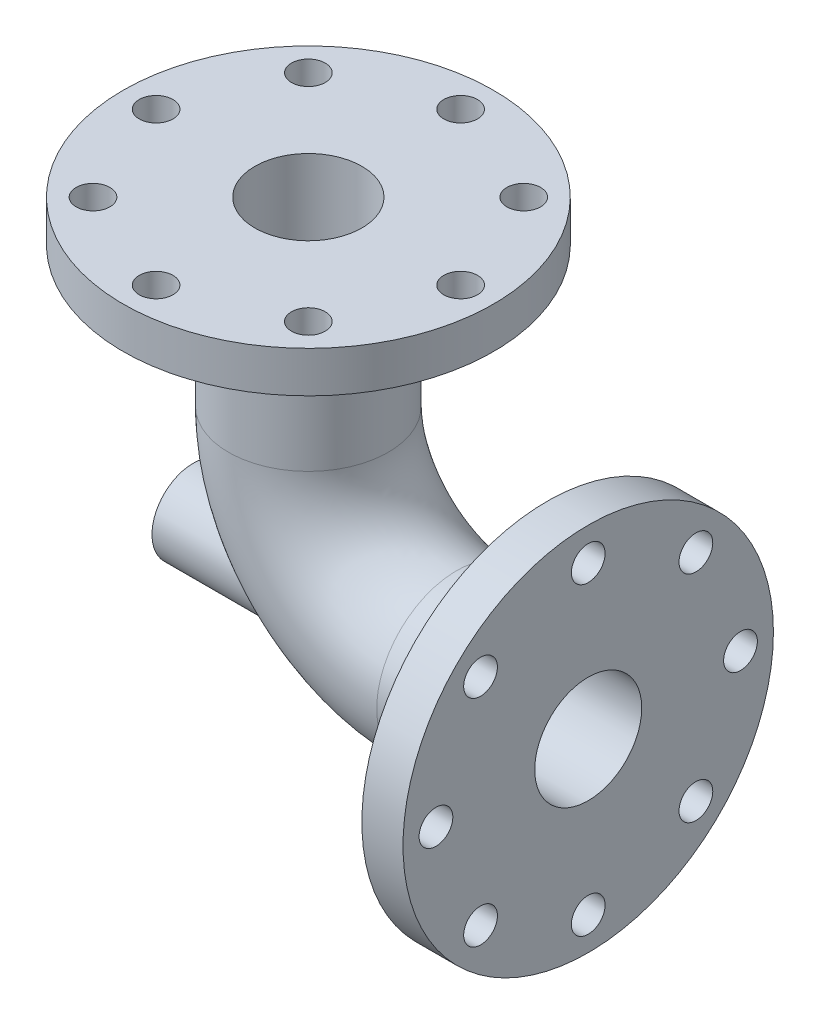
ISO-10303-21;
HEADER;
FILE_DESCRIPTION(('STEP AP214'),'2;1');
FILE_NAME('part.step','',(''),(''),'','','');
FILE_SCHEMA(('AUTOMOTIVE_DESIGN { 1 0 10303 214 1 1 1 1 }'));
ENDSEC;
DATA;
#1=APPLICATION_CONTEXT('core data for automotive mechanical design processes');
#2=APPLICATION_PROTOCOL_DEFINITION('international standard','automotive_design',2000,#1);
#3=PRODUCT_CONTEXT('',#1,'mechanical');
#4=PRODUCT('Part','Part','',(#3));
#5=PRODUCT_RELATED_PRODUCT_CATEGORY('part','',(#4));
#6=PRODUCT_DEFINITION_FORMATION('','',#4);
#7=PRODUCT_DEFINITION_CONTEXT('part definition',#1,'design');
#8=PRODUCT_DEFINITION('design','',#6,#7);
#9=PRODUCT_DEFINITION_SHAPE('','',#8);
#10=(LENGTH_UNIT() NAMED_UNIT(*) SI_UNIT(.MILLI.,.METRE.));
#11=(NAMED_UNIT(*) PLANE_ANGLE_UNIT() SI_UNIT($,.RADIAN.));
#12=(NAMED_UNIT(*) SI_UNIT($,.STERADIAN.) SOLID_ANGLE_UNIT());
#13=UNCERTAINTY_MEASURE_WITH_UNIT(LENGTH_MEASURE(1.E-05),#10,'distance_accuracy_value','');
#14=(GEOMETRIC_REPRESENTATION_CONTEXT(3) GLOBAL_UNCERTAINTY_ASSIGNED_CONTEXT((#13)) GLOBAL_UNIT_ASSIGNED_CONTEXT((#10,
#11,#12)) REPRESENTATION_CONTEXT('',''));
#15=CARTESIAN_POINT('',(0.,0.,0.));
#16=DIRECTION('',(0.,0.,1.));
#17=DIRECTION('',(1.,0.,0.));
#18=AXIS2_PLACEMENT_3D('',#15,#16,#17);
#19=CARTESIAN_POINT('',(0.,0.,0.));
#20=DIRECTION('',(0.,0.,-1.));
#21=DIRECTION('',(-1.,0.,0.));
#22=AXIS2_PLACEMENT_3D('',#19,#20,#21);
#23=TOROIDAL_SURFACE('',#22,90.,48.5);
#24=CARTESIAN_POINT('',(-90.,0.,0.));
#25=DIRECTION('',(0.,-1.,0.));
#26=DIRECTION('',(0.,0.,-1.));
#27=AXIS2_PLACEMENT_3D('',#24,#25,#26);
#28=CIRCLE('',#27,48.5);
#29=CARTESIAN_POINT('',(-90.,0.,-48.5));
#30=VERTEX_POINT('',#29);
#31=EDGE_CURVE('E41',#30,#30,#28,.T.);
#32=ORIENTED_EDGE('',*,*,#31,.T.);
#33=EDGE_LOOP('',(#32));
#34=FACE_BOUND('',#33,.T.);
#35=CARTESIAN_POINT('',(0.,-90.,0.));
#36=DIRECTION('',(1.,0.,0.));
#37=DIRECTION('',(0.,0.,-1.));
#38=AXIS2_PLACEMENT_3D('',#35,#36,#37);
#39=CIRCLE('',#38,48.5);
#40=CARTESIAN_POINT('',(0.,-90.,-48.5));
#41=VERTEX_POINT('',#40);
#42=EDGE_CURVE('E45',#41,#41,#39,.T.);
#43=ORIENTED_EDGE('',*,*,#42,.F.);
#44=EDGE_LOOP('',(#43));
#45=FACE_BOUND('',#44,.T.);
#46=CARTESIAN_POINT('',(-89.8449299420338,-96.875919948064,-24.035842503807));
#47=CARTESIAN_POINT('',(-89.2825330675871,-97.5468685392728,-23.8439036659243));
#48=CARTESIAN_POINT('',(-88.7304253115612,-98.2179177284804,-23.621553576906));
#49=CARTESIAN_POINT('',(-87.6507002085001,-99.5556563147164,-23.1128027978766));
#50=CARTESIAN_POINT('',(-87.1230864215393,-100.222345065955,-22.8263928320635));
#51=CARTESIAN_POINT('',(-86.0965582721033,-101.545396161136,-22.186554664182));
#52=CARTESIAN_POINT('',(-85.5976305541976,-102.201763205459,-21.8331579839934));
#53=CARTESIAN_POINT('',(-84.8738989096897,-103.173123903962,-21.2511488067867));
#54=CARTESIAN_POINT('',(-84.6367783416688,-103.494693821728,-21.048506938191));
#55=CARTESIAN_POINT('',(-84.1711191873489,-104.132603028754,-20.6256153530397));
#56=CARTESIAN_POINT('',(-83.9425828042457,-104.448940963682,-20.4053611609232));
#57=CARTESIAN_POINT('',(-83.3555767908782,-105.269697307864,-19.804842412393));
#58=CARTESIAN_POINT('',(-83.0045200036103,-105.768962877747,-19.4101271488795));
#59=CARTESIAN_POINT('',(-82.328599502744,-106.745583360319,-18.5741364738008));
#60=CARTESIAN_POINT('',(-82.0037307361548,-107.222942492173,-18.1328700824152));
#61=CARTESIAN_POINT('',(-81.3820615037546,-108.150413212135,-17.2044431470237));
#62=CARTESIAN_POINT('',(-81.0852548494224,-108.600530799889,-16.7172927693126));
#63=CARTESIAN_POINT('',(-80.5213707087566,-109.468010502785,-15.6985392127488));
#64=CARTESIAN_POINT('',(-80.2542937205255,-109.885372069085,-15.1669352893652));
#65=CARTESIAN_POINT('',(-79.7498574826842,-110.684098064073,-14.0583638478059));
#66=CARTESIAN_POINT('',(-79.5126893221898,-111.065227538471,-13.4811395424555));
#67=CARTESIAN_POINT('',(-79.0712894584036,-111.782983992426,-12.2876549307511));
#68=CARTESIAN_POINT('',(-78.8670584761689,-112.119609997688,-11.6713937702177));
#69=CARTESIAN_POINT('',(-78.4926410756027,-112.743040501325,-10.4044434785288));
#70=CARTESIAN_POINT('',(-78.3224466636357,-113.029856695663,-9.7537624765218));
#71=CARTESIAN_POINT('',(-78.0168742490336,-113.549091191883,-8.4231903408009));
#72=CARTESIAN_POINT('',(-77.8814922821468,-113.781515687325,-7.74330254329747));
#73=CARTESIAN_POINT('',(-77.6586541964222,-114.166479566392,-6.43398877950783));
#74=CARTESIAN_POINT('',(-77.5676323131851,-114.324886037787,-5.8068862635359));
#75=CARTESIAN_POINT('',(-77.4141521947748,-114.593042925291,-4.53894506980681));
#76=CARTESIAN_POINT('',(-77.3516918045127,-114.702797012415,-3.89810743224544));
#77=CARTESIAN_POINT('',(-77.2555422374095,-114.872111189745,-2.60792644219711));
#78=CARTESIAN_POINT('',(-77.2218432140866,-114.931688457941,-1.95858607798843));
#79=CARTESIAN_POINT('',(-77.18328099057,-114.999884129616,-0.65638216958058));
#80=CARTESIAN_POINT('',(-77.1784170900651,-115.00850377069,-0.00351871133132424));
#81=CARTESIAN_POINT('',(-77.1970068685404,-114.975609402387,1.26436086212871));
#82=CARTESIAN_POINT('',(-77.2189093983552,-114.936841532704,1.87947334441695));
#83=CARTESIAN_POINT('',(-77.2883974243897,-114.814218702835,3.10369888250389));
#84=CARTESIAN_POINT('',(-77.3359816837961,-114.730365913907,3.71281222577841));
#85=CARTESIAN_POINT('',(-77.4566949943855,-114.518622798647,4.92067552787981));
#86=CARTESIAN_POINT('',(-77.5298208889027,-114.390737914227,5.51942675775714));
#87=CARTESIAN_POINT('',(-77.7014100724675,-114.092490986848,6.70254179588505));
#88=CARTESIAN_POINT('',(-77.7998737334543,-113.922128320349,7.28690539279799));
#89=CARTESIAN_POINT('',(-78.0219992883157,-113.540702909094,8.4382226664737));
#90=CARTESIAN_POINT('',(-78.1456974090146,-113.3295816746,9.00514994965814));
#91=CARTESIAN_POINT('',(-78.4177997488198,-112.869297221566,10.1171822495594));
#92=CARTESIAN_POINT('',(-78.5662037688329,-112.620134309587,10.6622874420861));
#93=CARTESIAN_POINT('',(-78.8872148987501,-112.086610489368,11.7275979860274));
#94=CARTESIAN_POINT('',(-79.0598236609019,-111.802247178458,12.2478016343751));
#95=CARTESIAN_POINT('',(-79.4286014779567,-111.201485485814,13.2606082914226));
#96=CARTESIAN_POINT('',(-79.6247712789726,-110.885086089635,13.7532104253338));
#97=CARTESIAN_POINT('',(-80.0506281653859,-110.206525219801,14.7332842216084));
#98=CARTESIAN_POINT('',(-80.2815225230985,-109.84284476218,15.2191791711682));
#99=CARTESIAN_POINT('',(-80.7674875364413,-109.087789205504,16.1560616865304));
#100=CARTESIAN_POINT('',(-81.0225588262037,-108.6964133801,16.6070483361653));
#101=CARTESIAN_POINT('',(-81.5557232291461,-107.889965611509,17.4728118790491));
#102=CARTESIAN_POINT('',(-81.8338186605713,-107.474891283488,17.8875851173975));
#103=CARTESIAN_POINT('',(-82.4117279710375,-106.624980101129,18.680143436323));
#104=CARTESIAN_POINT('',(-82.7115446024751,-106.190140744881,19.0579238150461));
#105=CARTESIAN_POINT('',(-83.3663653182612,-105.254621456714,19.8166313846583));
#106=CARTESIAN_POINT('',(-83.7237831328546,-104.752038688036,20.1931292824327));
#107=CARTESIAN_POINT('',(-84.4616847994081,-103.731847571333,20.9002792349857));
#108=CARTESIAN_POINT('',(-84.8421697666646,-103.214238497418,21.2309290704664));
#109=CARTESIAN_POINT('',(-85.6242935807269,-102.167970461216,21.8474119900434));
#110=CARTESIAN_POINT('',(-86.0259438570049,-101.639305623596,22.1332205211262));
#111=CARTESIAN_POINT('',(-86.8481657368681,-100.574784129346,22.6611342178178));
#112=CARTESIAN_POINT('',(-87.2687409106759,-100.038926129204,22.9032310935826));
#113=CARTESIAN_POINT('',(-88.0215438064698,-99.095017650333,23.2910591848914));
#114=CARTESIAN_POINT('',(-88.3501870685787,-98.6878015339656,23.4458710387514));
#115=CARTESIAN_POINT('',(-89.0160615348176,-97.8723336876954,23.7321102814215));
#116=CARTESIAN_POINT('',(-89.3532913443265,-97.4640821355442,23.8635414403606));
#117=CARTESIAN_POINT('',(-90.3769650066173,-96.2388170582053,24.2240039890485));
#118=CARTESIAN_POINT('',(-91.075234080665,-95.4214924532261,24.4191236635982));
#119=CARTESIAN_POINT('',(-92.4973777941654,-93.7915270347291,24.7247495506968));
#120=CARTESIAN_POINT('',(-93.2212904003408,-92.9788954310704,24.8351243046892));
#121=CARTESIAN_POINT('',(-94.6876879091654,-91.3637986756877,24.9759287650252));
#122=CARTESIAN_POINT('',(-95.4301709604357,-90.5613325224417,25.0063664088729));
#123=CARTESIAN_POINT('',(-96.9439834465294,-88.9526616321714,24.9912743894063));
#124=CARTESIAN_POINT('',(-97.7155908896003,-88.1467363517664,24.9441255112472));
#125=CARTESIAN_POINT('',(-99.2668088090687,-86.5507680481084,24.7739148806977));
#126=CARTESIAN_POINT('',(-100.04641968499,-85.7607258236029,24.6508493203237));
#127=CARTESIAN_POINT('',(-101.608315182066,-84.1983037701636,24.3305646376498));
#128=CARTESIAN_POINT('',(-102.390600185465,-83.4259265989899,24.1333344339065));
#129=CARTESIAN_POINT('',(-103.95225140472,-81.9008503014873,23.6651647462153));
#130=CARTESIAN_POINT('',(-104.731617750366,-81.1481502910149,23.3942285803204));
#131=CARTESIAN_POINT('',(-106.278537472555,-79.6676890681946,22.7790103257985));
#132=CARTESIAN_POINT('',(-107.046126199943,-78.9398381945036,22.4350337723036));
#133=CARTESIAN_POINT('',(-108.566567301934,-77.5087171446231,21.6708553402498));
#134=CARTESIAN_POINT('',(-109.319417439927,-76.8054506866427,21.2506419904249));
#135=CARTESIAN_POINT('',(-110.801945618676,-75.4286836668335,20.3312856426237));
#136=CARTESIAN_POINT('',(-111.531651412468,-74.7551470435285,19.8322418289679));
#137=CARTESIAN_POINT('',(-112.959739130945,-73.4429670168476,18.7506565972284));
#138=CARTESIAN_POINT('',(-113.658136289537,-72.8043066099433,18.1681563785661));
#139=CARTESIAN_POINT('',(-114.776704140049,-71.7848842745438,17.1329552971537));
#140=CARTESIAN_POINT('',(-115.209129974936,-71.3917081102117,16.7056127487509));
#141=CARTESIAN_POINT('',(-116.052136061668,-70.6266106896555,15.8119500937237));
#142=CARTESIAN_POINT('',(-116.462717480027,-70.2546882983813,15.3456320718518));
#143=CARTESIAN_POINT('',(-117.256988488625,-69.5362369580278,14.3735588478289));
#144=CARTESIAN_POINT('',(-117.640713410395,-69.1896746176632,13.8678573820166));
#145=CARTESIAN_POINT('',(-118.376703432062,-68.5256972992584,12.815662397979));
#146=CARTESIAN_POINT('',(-118.728965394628,-68.2082852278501,12.2691648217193));
#147=CARTESIAN_POINT('',(-119.323014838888,-67.6734465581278,11.2594986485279));
#148=CARTESIAN_POINT('',(-119.572131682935,-67.4493195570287,10.8041833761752));
#149=CARTESIAN_POINT('',(-120.044050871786,-67.0249544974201,9.8696715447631));
#150=CARTESIAN_POINT('',(-120.266867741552,-66.8247032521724,9.39048837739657));
#151=CARTESIAN_POINT('',(-120.682901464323,-66.450944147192,8.40936763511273));
#152=CARTESIAN_POINT('',(-120.876121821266,-66.2774331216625,7.90743276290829));
#153=CARTESIAN_POINT('',(-121.229529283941,-65.9601608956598,6.88285373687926));
#154=CARTESIAN_POINT('',(-121.389716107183,-65.816399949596,6.36020940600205));
#155=CARTESIAN_POINT('',(-121.675149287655,-65.5602827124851,5.29195946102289));
#156=CARTESIAN_POINT('',(-121.800030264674,-65.4482548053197,4.74617651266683));
#157=CARTESIAN_POINT('',(-122.009707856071,-65.260178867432,3.64080679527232));
#158=CARTESIAN_POINT('',(-122.094504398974,-65.1841309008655,3.08122000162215));
#159=CARTESIAN_POINT('',(-122.221733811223,-65.0700338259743,1.95384436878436));
#160=CARTESIAN_POINT('',(-122.264200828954,-65.031954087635,1.38606251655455));
#161=CARTESIAN_POINT('',(-122.305697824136,-64.9947440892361,0.247677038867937));
#162=CARTESIAN_POINT('',(-122.304734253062,-64.9956080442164,-0.322926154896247));
#163=CARTESIAN_POINT('',(-122.262873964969,-65.0331439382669,-1.37464340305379));
#164=CARTESIAN_POINT('',(-122.228051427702,-65.0643691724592,-1.85621388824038));
#165=CARTESIAN_POINT('',(-122.127908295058,-65.1541742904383,-2.81353825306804));
#166=CARTESIAN_POINT('',(-122.062591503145,-65.2127507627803,-3.28929285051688));
#167=CARTESIAN_POINT('',(-121.902696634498,-65.3561629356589,-4.23185779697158));
#168=CARTESIAN_POINT('',(-121.808115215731,-65.4410016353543,-4.6986671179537));
#169=CARTESIAN_POINT('',(-121.591374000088,-65.6354502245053,-5.62055947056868));
#170=CARTESIAN_POINT('',(-121.469212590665,-65.745061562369,-6.07564181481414));
#171=CARTESIAN_POINT('',(-121.197566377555,-65.9888572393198,-6.97753560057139));
#172=CARTESIAN_POINT('',(-121.047753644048,-66.123336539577,-7.4241680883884));
#173=CARTESIAN_POINT('',(-120.724114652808,-66.4139404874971,-8.30128669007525));
#174=CARTESIAN_POINT('',(-120.550289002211,-66.5700645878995,-8.73177321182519));
#175=CARTESIAN_POINT('',(-119.996130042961,-67.0679852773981,-9.99720214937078));
#176=CARTESIAN_POINT('',(-119.583049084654,-67.4393891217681,-10.8063262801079));
#177=CARTESIAN_POINT('',(-118.423015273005,-68.4836581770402,-12.8048196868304));
#178=CARTESIAN_POINT('',(-117.622625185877,-69.2053193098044,-13.9378008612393));
#179=CARTESIAN_POINT('',(-116.332954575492,-70.3721724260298,-15.4975033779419));
#180=CARTESIAN_POINT('',(-115.887374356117,-70.7759502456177,-15.9948427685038));
#181=CARTESIAN_POINT('',(-114.971382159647,-71.6077886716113,-16.9447519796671));
#182=CARTESIAN_POINT('',(-114.500970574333,-72.0358488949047,-17.3973225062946));
#183=CARTESIAN_POINT('',(-113.670679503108,-72.7933896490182,-18.1420261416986));
#184=CARTESIAN_POINT('',(-113.315462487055,-73.1180842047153,-18.4443598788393));
#185=CARTESIAN_POINT('',(-112.595911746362,-73.777264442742,-19.0267230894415));
#186=CARTESIAN_POINT('',(-112.231577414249,-74.1117507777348,-19.3067510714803));
#187=CARTESIAN_POINT('',(-111.126750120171,-75.1286336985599,-20.1144870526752));
#188=CARTESIAN_POINT('',(-110.374556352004,-75.8243417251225,-20.6097376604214));
#189=CARTESIAN_POINT('',(-108.847730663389,-77.2457590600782,-21.5184064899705));
#190=CARTESIAN_POINT('',(-108.073070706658,-77.9715063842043,-21.931716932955));
#191=CARTESIAN_POINT('',(-106.509829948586,-79.4480112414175,-22.679064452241));
#192=CARTESIAN_POINT('',(-105.721251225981,-80.1987650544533,-23.0131132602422));
#193=CARTESIAN_POINT('',(-104.107386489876,-81.7505320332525,-23.6149152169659));
#194=CARTESIAN_POINT('',(-103.281820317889,-82.552377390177,-23.8797646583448));
#195=CARTESIAN_POINT('',(-101.629223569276,-84.1774831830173,-24.3271165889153));
#196=CARTESIAN_POINT('',(-100.802192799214,-85.0007466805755,-24.5096072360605));
#197=CARTESIAN_POINT('',(-99.1549972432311,-86.6645875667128,-24.7908324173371));
#198=CARTESIAN_POINT('',(-98.3348214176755,-87.505123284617,-24.8897487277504));
#199=CARTESIAN_POINT('',(-96.7061053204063,-89.2027650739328,-25.0017535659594));
#200=CARTESIAN_POINT('',(-95.8975610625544,-90.059865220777,-25.0148722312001));
#201=CARTESIAN_POINT('',(-94.6452991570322,-91.4131242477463,-24.9648320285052));
#202=CARTESIAN_POINT('',(-94.1953011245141,-91.9047642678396,-24.9322603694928));
#203=CARTESIAN_POINT('',(-93.302486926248,-92.8916216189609,-24.8371547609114));
#204=CARTESIAN_POINT('',(-92.8596699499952,-93.3868385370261,-24.7746242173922));
#205=CARTESIAN_POINT('',(-91.9822842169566,-94.3802493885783,-24.6184152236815));
#206=CARTESIAN_POINT('',(-91.547720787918,-94.8784449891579,-24.5247173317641));
#207=CARTESIAN_POINT('',(-90.6885106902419,-95.8763816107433,-24.3049222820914));
#208=CARTESIAN_POINT('',(-90.2638656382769,-96.3761228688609,-24.1788198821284));
#209=CARTESIAN_POINT('',(-89.8449299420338,-96.875919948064,-24.035842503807));
#210=B_SPLINE_CURVE_WITH_KNOTS('',3,(#46,#47,#48,#49,#50,#51,#52,#53,#54,#55,#56,#57,#58,#59,
#60,#61,#62,#63,#64,#65,#66,#67,#68,#69,#70,#71,#72,#73,#74,#75,#76,#77,#78,#79,#80,#81,#82,#83,
#84,#85,#86,#87,#88,#89,#90,#91,#92,#93,#94,#95,#96,#97,#98,#99,#100,#101,#102,#103,#104,#105,
#106,#107,#108,#109,#110,#111,#112,#113,#114,#115,#116,#117,#118,#119,#120,#121,#122,#123,#124,
#125,#126,#127,#128,#129,#130,#131,#132,#133,#134,#135,#136,#137,#138,#139,#140,#141,#142,#143,
#144,#145,#146,#147,#148,#149,#150,#151,#152,#153,#154,#155,#156,#157,#158,#159,#160,#161,#162,
#163,#164,#165,#166,#167,#168,#169,#170,#171,#172,#173,#174,#175,#176,#177,#178,#179,#180,#181,
#182,#183,#184,#185,#186,#187,#188,#189,#190,#191,#192,#193,#194,#195,#196,#197,#198,#199,#200,
#201,#202,#203,#204,#205,#206,#207,#208,#209),.UNSPECIFIED.,.T.,.F.,(4,2,2,2,2,2,2,2,2,2,2,2,2,
2,2,2,2,2,2,2,2,2,2,2,2,2,2,2,2,2,2,2,2,2,2,2,2,2,2,2,2,2,2,2,2,2,2,2,2,2,2,2,2,2,2,2,2,2,2,2,2,
2,2,2,2,2,2,2,2,2,2,2,2,2,2,2,2,2,2,2,2,4),(0.,2.68836013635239,5.3771097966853,
8.06459734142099,9.40818183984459,10.75210885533,12.9303384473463,15.1081467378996,
17.2854736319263,19.4628370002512,21.6534738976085,23.8441587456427,26.0343284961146,
28.2242487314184,30.1812636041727,32.1381307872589,34.0943277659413,36.0504772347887,
37.8984473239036,39.7463284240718,41.5939812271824,43.4416611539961,45.2920125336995,
47.1423490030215,48.9928118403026,50.8433332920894,52.789354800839,54.7354273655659,
56.6816961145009,58.6282119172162,60.7937589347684,62.9594107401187,65.1262442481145,
67.293488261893,68.9300418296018,70.5663312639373,73.8397097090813,77.1181557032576,
80.3962761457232,83.7436817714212,87.0912553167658,90.4393292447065,93.787252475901,
97.1214375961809,100.456124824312,103.786649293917,107.115535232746,109.286145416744,
111.456639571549,113.624222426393,115.792021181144,117.486578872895,119.180196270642,
120.873613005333,122.567044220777,124.277407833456,125.987774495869,127.696760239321,
129.405492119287,130.855258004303,132.304843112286,133.75459382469,135.204429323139,
136.672715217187,138.140963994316,141.07677831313,145.73999390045,148.07965349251,
150.419276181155,152.123742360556,153.828322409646,157.238079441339,160.652292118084,
164.06599913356,167.605767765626,171.146045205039,174.678602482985,178.209918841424,
180.211161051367,182.212175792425,184.214441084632,186.217030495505),.UNSPECIFIED.);
#211=CARTESIAN_POINT('',(-89.8449299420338,-96.875919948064,-24.035842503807));
#212=VERTEX_POINT('',#211);
#213=EDGE_CURVE('E10',#212,#212,#210,.T.);
#214=ORIENTED_EDGE('',*,*,#213,.F.);
#215=EDGE_LOOP('',(#214));
#216=FACE_BOUND('',#215,.T.);
#217=ADVANCED_FACE('F29',(#34,#45,#216),#23,.T.);
#218=CARTESIAN_POINT('',(-90.,0.,0.));
#219=DIRECTION('',(0.,1.,0.));
#220=DIRECTION('',(0.,0.,1.));
#221=AXIS2_PLACEMENT_3D('',#218,#219,#220);
#222=CYLINDRICAL_SURFACE('',#221,48.5);
#223=ORIENTED_EDGE('',*,*,#31,.F.);
#224=EDGE_LOOP('',(#223));
#225=FACE_BOUND('',#224,.T.);
#226=CARTESIAN_POINT('',(-90.,85.,0.));
#227=DIRECTION('',(0.,1.,0.));
#228=DIRECTION('',(-1.,0.,0.));
#229=AXIS2_PLACEMENT_3D('',#226,#227,#228);
#230=CIRCLE('',#229,48.5);
#231=CARTESIAN_POINT('',(-138.5,85.,0.));
#232=VERTEX_POINT('',#231);
#233=EDGE_CURVE('E185',#232,#232,#230,.T.);
#234=ORIENTED_EDGE('',*,*,#233,.F.);
#235=EDGE_LOOP('',(#234));
#236=FACE_BOUND('',#235,.T.);
#237=ADVANCED_FACE('F31',(#225,#236),#222,.T.);
#238=CARTESIAN_POINT('',(0.,-90.,0.));
#239=DIRECTION('',(1.,0.,0.));
#240=DIRECTION('',(0.,0.,-1.));
#241=AXIS2_PLACEMENT_3D('',#238,#239,#240);
#242=CYLINDRICAL_SURFACE('',#241,48.5);
#243=ORIENTED_EDGE('',*,*,#42,.T.);
#244=EDGE_LOOP('',(#243));
#245=FACE_BOUND('',#244,.T.);
#246=CARTESIAN_POINT('',(55.,-90.,0.));
#247=DIRECTION('',(1.,0.,0.));
#248=DIRECTION('',(0.,0.,-1.));
#249=AXIS2_PLACEMENT_3D('',#246,#247,#248);
#250=CIRCLE('',#249,48.5);
#251=CARTESIAN_POINT('',(55.,-90.,-48.5));
#252=VERTEX_POINT('',#251);
#253=EDGE_CURVE('E177',#252,#252,#250,.T.);
#254=ORIENTED_EDGE('',*,*,#253,.F.);
#255=EDGE_LOOP('',(#254));
#256=FACE_BOUND('',#255,.T.);
#257=ADVANCED_FACE('F153',(#245,#256),#242,.T.);
#258=CARTESIAN_POINT('',(-90.,0.,0.));
#259=DIRECTION('',(0.,1.,0.));
#260=DIRECTION('',(0.,0.,1.));
#261=AXIS2_PLACEMENT_3D('',#258,#259,#260);
#262=CYLINDRICAL_SURFACE('',#261,32.5);
#263=CARTESIAN_POINT('',(-90.,0.,0.));
#264=DIRECTION('',(0.,-1.,0.));
#265=DIRECTION('',(0.,0.,-1.));
#266=AXIS2_PLACEMENT_3D('',#263,#264,#265);
#267=CIRCLE('',#266,32.5);
#268=CARTESIAN_POINT('',(-90.,0.,-32.5));
#269=VERTEX_POINT('',#268);
#270=EDGE_CURVE('E180',#269,#269,#267,.T.);
#271=ORIENTED_EDGE('',*,*,#270,.T.);
#272=EDGE_LOOP('',(#271));
#273=FACE_BOUND('',#272,.T.);
#274=CARTESIAN_POINT('',(-90.,110.,0.));
#275=DIRECTION('',(0.,1.,0.));
#276=DIRECTION('',(-1.,0.,0.));
#277=AXIS2_PLACEMENT_3D('',#274,#275,#276);
#278=CIRCLE('',#277,32.5);
#279=CARTESIAN_POINT('',(-122.5,110.,0.));
#280=VERTEX_POINT('',#279);
#281=EDGE_CURVE('E194',#280,#280,#278,.T.);
#282=ORIENTED_EDGE('',*,*,#281,.T.);
#283=EDGE_LOOP('',(#282));
#284=FACE_BOUND('',#283,.T.);
#285=ADVANCED_FACE('F150',(#273,#284),#262,.F.);
#286=CARTESIAN_POINT('',(0.,0.,0.));
#287=DIRECTION('',(0.,0.,-1.));
#288=DIRECTION('',(-1.,0.,0.));
#289=AXIS2_PLACEMENT_3D('',#286,#287,#288);
#290=TOROIDAL_SURFACE('',#289,90.,32.5);
#291=CARTESIAN_POINT('',(-91.5550325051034,-80.9612495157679,-4.27796560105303));
#292=CARTESIAN_POINT('',(-91.7414521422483,-80.8131570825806,-3.96503310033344));
#293=CARTESIAN_POINT('',(-91.9124105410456,-80.677630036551,-3.63661544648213));
#294=CARTESIAN_POINT('',(-92.1389806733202,-80.4982489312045,-3.12246576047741));
#295=CARTESIAN_POINT('',(-92.2095625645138,-80.4424114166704,-2.94737357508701));
#296=CARTESIAN_POINT('',(-92.3395862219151,-80.3396076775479,-2.59060529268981));
#297=CARTESIAN_POINT('',(-92.3990327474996,-80.2926376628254,-2.40893204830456));
#298=CARTESIAN_POINT('',(-92.5061390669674,-80.2080480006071,-2.03817298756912));
#299=CARTESIAN_POINT('',(-92.5536900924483,-80.1705146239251,-1.84903586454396));
#300=CARTESIAN_POINT('',(-92.6352659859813,-80.1061446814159,-1.46605566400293));
#301=CARTESIAN_POINT('',(-92.6692908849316,-80.0793080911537,-1.27221259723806));
#302=CARTESIAN_POINT('',(-92.7229532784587,-80.0369903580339,-0.881484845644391));
#303=CARTESIAN_POINT('',(-92.7426036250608,-80.0214990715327,-0.684603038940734));
#304=CARTESIAN_POINT('',(-92.7670474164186,-80.0022297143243,-0.289351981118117));
#305=CARTESIAN_POINT('',(-92.771842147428,-79.9984506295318,-0.0909828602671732));
#306=CARTESIAN_POINT('',(-92.7666868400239,-80.0025143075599,0.288188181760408));
#307=CARTESIAN_POINT('',(-92.7579811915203,-80.0093762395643,0.469019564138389));
#308=CARTESIAN_POINT('',(-92.7282806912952,-80.0327911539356,0.829024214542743));
#309=CARTESIAN_POINT('',(-92.7072865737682,-80.0493435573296,1.00819758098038));
#310=CARTESIAN_POINT('',(-92.6534540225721,-80.0917995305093,1.36367976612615));
#311=CARTESIAN_POINT('',(-92.6206116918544,-80.1177061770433,1.53998762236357));
#312=CARTESIAN_POINT('',(-92.5437465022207,-80.1783635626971,1.88858821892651));
#313=CARTESIAN_POINT('',(-92.4997231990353,-80.2131146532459,2.06088079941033));
#314=CARTESIAN_POINT('',(-92.4014727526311,-80.2907110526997,2.39996982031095));
#315=CARTESIAN_POINT('',(-92.3472815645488,-80.3335278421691,2.56678326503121));
#316=CARTESIAN_POINT('',(-92.2294627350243,-80.4266736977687,2.8949156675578));
#317=CARTESIAN_POINT('',(-92.1658321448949,-80.4770051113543,3.05623288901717));
#318=CARTESIAN_POINT('',(-91.9621636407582,-80.6382181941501,3.53110792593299));
#319=CARTESIAN_POINT('',(-91.8093037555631,-80.7593543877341,3.83574073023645));
#320=CARTESIAN_POINT('',(-91.3697772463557,-81.1083098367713,4.60585715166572));
#321=CARTESIAN_POINT('',(-91.0600288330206,-81.3548333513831,5.04971859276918));
#322=CARTESIAN_POINT('',(-90.5587822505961,-81.7553747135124,5.66447943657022));
#323=CARTESIAN_POINT('',(-90.3852506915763,-81.8942922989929,5.8612021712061));
#324=CARTESIAN_POINT('',(-90.0279841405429,-82.1809099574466,6.23841835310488));
#325=CARTESIAN_POINT('',(-89.8442494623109,-82.3286097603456,6.4189122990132));
#326=CARTESIAN_POINT('',(-89.3667849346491,-82.7133411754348,6.85784635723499));
#327=CARTESIAN_POINT('',(-89.0673390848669,-82.9554598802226,7.10560740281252));
#328=CARTESIAN_POINT('',(-88.453919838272,-83.4535291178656,7.56696633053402));
#329=CARTESIAN_POINT('',(-88.1399387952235,-83.7094869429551,7.78054596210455));
#330=CARTESIAN_POINT('',(-87.5009220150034,-84.2328730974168,8.17606140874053));
#331=CARTESIAN_POINT('',(-87.1758706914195,-84.5003177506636,8.35795019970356));
#332=CARTESIAN_POINT('',(-86.5181570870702,-85.0443117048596,8.69154324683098));
#333=CARTESIAN_POINT('',(-86.1854953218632,-85.3208603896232,8.84324954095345));
#334=CARTESIAN_POINT('',(-85.392182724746,-85.9841801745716,9.16815710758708));
#335=CARTESIAN_POINT('',(-84.9292031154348,-86.3742846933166,9.32893988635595));
#336=CARTESIAN_POINT('',(-83.9979576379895,-87.1659972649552,9.59913563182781));
#337=CARTESIAN_POINT('',(-83.5296897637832,-87.5676097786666,9.70852838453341));
#338=CARTESIAN_POINT('',(-82.591857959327,-88.3800148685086,9.87662553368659));
#339=CARTESIAN_POINT('',(-82.1222937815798,-88.790809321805,9.93531946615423));
#340=CARTESIAN_POINT('',(-81.1857480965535,-89.6192190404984,10.0013801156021));
#341=CARTESIAN_POINT('',(-80.7187658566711,-90.036832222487,10.0087622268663));
#342=CARTESIAN_POINT('',(-79.8719324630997,-90.8032874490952,9.97371978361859));
#343=CARTESIAN_POINT('',(-79.4910836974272,-91.151426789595,9.93975362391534));
#344=CARTESIAN_POINT('',(-78.7358576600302,-91.8491099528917,9.83388486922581));
#345=CARTESIAN_POINT('',(-78.3614806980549,-92.1986538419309,9.7619804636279));
#346=CARTESIAN_POINT('',(-77.622498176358,-92.8963244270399,9.57816422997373));
#347=CARTESIAN_POINT('',(-77.2578769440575,-93.2444525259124,9.46632130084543));
#348=CARTESIAN_POINT('',(-76.5409049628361,-93.9369366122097,9.199895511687));
#349=CARTESIAN_POINT('',(-76.1885493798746,-94.2812940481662,9.04532970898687));
#350=CARTESIAN_POINT('',(-75.6058395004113,-94.8575254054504,8.74500356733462));
#351=CARTESIAN_POINT('',(-75.371299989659,-95.0914134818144,8.61116232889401));
#352=CARTESIAN_POINT('',(-74.9113667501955,-95.553859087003,8.32041089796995));
#353=CARTESIAN_POINT('',(-74.6859725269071,-95.7824169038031,8.16350195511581));
#354=CARTESIAN_POINT('',(-74.2463207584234,-96.231900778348,7.82574977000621));
#355=CARTESIAN_POINT('',(-74.0320515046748,-96.4528347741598,7.64493243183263));
#356=CARTESIAN_POINT('',(-73.6163664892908,-96.8848915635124,7.25825703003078));
#357=CARTESIAN_POINT('',(-73.4149521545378,-97.0960132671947,7.05239619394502));
#358=CARTESIAN_POINT('',(-73.0703670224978,-97.4599873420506,6.66355261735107));
#359=CARTESIAN_POINT('',(-72.9241819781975,-97.6153827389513,6.48561307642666));
#360=CARTESIAN_POINT('',(-72.6423167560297,-97.9167288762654,6.11412933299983));
#361=CARTESIAN_POINT('',(-72.506634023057,-98.062681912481,5.92058894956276));
#362=CARTESIAN_POINT('',(-72.2472006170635,-98.3432541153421,5.51817248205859));
#363=CARTESIAN_POINT('',(-72.1234405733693,-98.4778821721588,5.30930867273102));
#364=CARTESIAN_POINT('',(-71.8891830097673,-98.7339622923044,4.8765840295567));
#365=CARTESIAN_POINT('',(-71.7786833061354,-98.8554165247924,4.65272567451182));
#366=CARTESIAN_POINT('',(-71.5897596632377,-99.0639704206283,4.22969713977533));
#367=CARTESIAN_POINT('',(-71.5090653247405,-99.1534142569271,4.03269337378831));
#368=CARTESIAN_POINT('',(-71.3587499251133,-99.3205599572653,3.62970029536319));
#369=CARTESIAN_POINT('',(-71.2891267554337,-99.3982640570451,3.42371270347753));
#370=CARTESIAN_POINT('',(-71.1617786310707,-99.5407741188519,3.00379326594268));
#371=CARTESIAN_POINT('',(-71.104050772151,-99.6055832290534,2.78986337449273));
#372=CARTESIAN_POINT('',(-71.0012175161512,-99.7212748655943,2.35528542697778));
#373=CARTESIAN_POINT('',(-70.9561123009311,-99.7721571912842,2.13463727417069));
#374=CARTESIAN_POINT('',(-70.8789697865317,-99.8593111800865,1.68707055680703));
#375=CARTESIAN_POINT('',(-70.8469969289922,-99.8955107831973,1.46012677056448));
#376=CARTESIAN_POINT('',(-70.7969136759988,-99.9522637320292,1.00276721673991));
#377=CARTESIAN_POINT('',(-70.7788033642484,-99.9728169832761,0.772351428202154));
#378=CARTESIAN_POINT('',(-70.7567291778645,-99.9978735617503,0.310015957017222));
#379=CARTESIAN_POINT('',(-70.7527625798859,-100.002379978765,0.0780965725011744));
#380=CARTESIAN_POINT('',(-70.7590321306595,-99.9952606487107,-0.385292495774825));
#381=CARTESIAN_POINT('',(-70.7692674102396,-99.9836358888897,-0.616762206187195));
#382=CARTESIAN_POINT('',(-70.8023603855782,-99.9460942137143,-1.0584133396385));
#383=CARTESIAN_POINT('',(-70.8241158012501,-99.9214256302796,-1.26878583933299));
#384=CARTESIAN_POINT('',(-70.8791733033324,-99.859094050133,-1.68604768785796));
#385=CARTESIAN_POINT('',(-70.9124746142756,-99.8214319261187,-1.89293726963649));
#386=CARTESIAN_POINT('',(-70.990203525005,-99.7337077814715,-2.30188227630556));
#387=CARTESIAN_POINT('',(-71.0346288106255,-99.6836483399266,-2.50393869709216));
#388=CARTESIAN_POINT('',(-71.1341078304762,-99.5718402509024,-2.90218367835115));
#389=CARTESIAN_POINT('',(-71.1891655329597,-99.510087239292,-3.09837001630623));
#390=CARTESIAN_POINT('',(-71.3113553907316,-99.3734492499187,-3.4904157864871));
#391=CARTESIAN_POINT('',(-71.3788357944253,-99.2981877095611,-3.68603506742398));
#392=CARTESIAN_POINT('',(-71.5238232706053,-99.1370515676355,-4.0690892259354));
#393=CARTESIAN_POINT('',(-71.6013342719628,-99.0511728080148,-4.25652085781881));
#394=CARTESIAN_POINT('',(-71.7656278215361,-98.8698509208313,-4.62249420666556));
#395=CARTESIAN_POINT('',(-71.8524113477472,-98.7744067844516,-4.80103498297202));
#396=CARTESIAN_POINT('',(-72.0345044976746,-98.5749826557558,-5.14877335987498));
#397=CARTESIAN_POINT('',(-72.1298158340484,-98.4710009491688,-5.31796907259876));
#398=CARTESIAN_POINT('',(-72.3718788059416,-98.2080990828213,-5.71901765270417));
#399=CARTESIAN_POINT('',(-72.5228214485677,-98.0451260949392,-5.94570877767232));
#400=CARTESIAN_POINT('',(-72.8388177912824,-97.7063179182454,-6.37873893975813));
#401=CARTESIAN_POINT('',(-73.0038762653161,-97.5304783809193,-6.58507104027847));
#402=CARTESIAN_POINT('',(-73.3464848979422,-97.1681353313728,-6.97777361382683));
#403=CARTESIAN_POINT('',(-73.5240550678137,-96.981614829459,-7.16411084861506));
#404=CARTESIAN_POINT('',(-73.8897485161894,-96.6003423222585,-7.51684415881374));
#405=CARTESIAN_POINT('',(-74.077872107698,-96.4055900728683,-7.6832396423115));
#406=CARTESIAN_POINT('',(-74.5356724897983,-95.9352277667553,-8.05566856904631));
#407=CARTESIAN_POINT('',(-74.8094227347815,-95.6567423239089,-8.25308956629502));
#408=CARTESIAN_POINT('',(-75.3708606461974,-95.0915363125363,-8.61328249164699));
#409=CARTESIAN_POINT('',(-75.6585533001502,-94.804812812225,-8.77604190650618));
#410=CARTESIAN_POINT('',(-76.2454099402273,-94.225913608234,-9.0690128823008));
#411=CARTESIAN_POINT('',(-76.5445857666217,-93.9337324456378,-9.19918974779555));
#412=CARTESIAN_POINT('',(-77.1518087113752,-93.3466011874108,-9.42865881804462));
#413=CARTESIAN_POINT('',(-77.4598558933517,-93.0516510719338,-9.52795080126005));
#414=CARTESIAN_POINT('',(-78.1948580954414,-92.3546398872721,-9.72780773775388));
#415=CARTESIAN_POINT('',(-78.6247891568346,-91.9521501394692,-9.81602568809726));
#416=CARTESIAN_POINT('',(-79.4935251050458,-91.1487877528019,-9.94211653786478));
#417=CARTESIAN_POINT('',(-79.9323331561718,-90.7479157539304,-9.97997115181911));
#418=CARTESIAN_POINT('',(-80.8159602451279,-89.9497877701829,-10.0078553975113));
#419=CARTESIAN_POINT('',(-81.2607878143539,-89.5525386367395,-9.99780802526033));
#420=CARTESIAN_POINT('',(-82.1524823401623,-88.7644498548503,-9.93125297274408));
#421=CARTESIAN_POINT('',(-82.5993489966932,-88.3736092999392,-9.87475192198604));
#422=CARTESIAN_POINT('',(-83.4996234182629,-87.593572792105,-9.71443961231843));
#423=CARTESIAN_POINT('',(-83.953013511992,-87.2045172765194,-9.60984185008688));
#424=CARTESIAN_POINT('',(-84.855233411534,-86.4368994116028,-9.35244752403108));
#425=CARTESIAN_POINT('',(-85.3040618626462,-86.0583401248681,-9.19963705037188));
#426=CARTESIAN_POINT('',(-86.1923259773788,-85.3147690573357,-8.8441085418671));
#427=CARTESIAN_POINT('',(-86.6317731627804,-84.9497401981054,-8.64145607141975));
#428=CARTESIAN_POINT('',(-87.2798806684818,-84.41489402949,-8.29767416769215));
#429=CARTESIAN_POINT('',(-87.4940324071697,-84.2387608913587,-8.17647353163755));
#430=CARTESIAN_POINT('',(-87.9178395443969,-83.8912565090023,-7.92021908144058));
#431=CARTESIAN_POINT('',(-88.1274956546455,-83.7198845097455,-7.78516747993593));
#432=CARTESIAN_POINT('',(-88.5747577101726,-83.3553243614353,-7.47756652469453));
#433=CARTESIAN_POINT('',(-88.8114061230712,-83.1630853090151,-7.30248421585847));
#434=CARTESIAN_POINT('',(-89.2753177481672,-82.7873411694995,-6.93161160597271));
#435=CARTESIAN_POINT('',(-89.5025806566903,-82.6038363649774,-6.7358206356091));
#436=CARTESIAN_POINT('',(-89.9442288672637,-82.2481612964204,-6.32320025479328));
#437=CARTESIAN_POINT('',(-90.1586668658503,-82.0759443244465,-6.1064681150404));
#438=CARTESIAN_POINT('',(-90.5724704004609,-81.7443772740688,-5.65014733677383));
#439=CARTESIAN_POINT('',(-90.7718446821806,-81.5850197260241,-5.41057214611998));
#440=CARTESIAN_POINT('',(-91.1722773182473,-81.2655868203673,-4.88016784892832));
#441=CARTESIAN_POINT('',(-91.3711745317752,-81.1073069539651,-4.58659797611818));
#442=CARTESIAN_POINT('',(-91.5550325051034,-80.9612495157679,-4.27796560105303));
#443=B_SPLINE_CURVE_WITH_KNOTS('',3,(#291,#292,#293,#294,#295,#296,#297,#298,#299,#300,#301,
#302,#303,#304,#305,#306,#307,#308,#309,#310,#311,#312,#313,#314,#315,#316,#317,#318,#319,#320,
#321,#322,#323,#324,#325,#326,#327,#328,#329,#330,#331,#332,#333,#334,#335,#336,#337,#338,#339,
#340,#341,#342,#343,#344,#345,#346,#347,#348,#349,#350,#351,#352,#353,#354,#355,#356,#357,#358,
#359,#360,#361,#362,#363,#364,#365,#366,#367,#368,#369,#370,#371,#372,#373,#374,#375,#376,#377,
#378,#379,#380,#381,#382,#383,#384,#385,#386,#387,#388,#389,#390,#391,#392,#393,#394,#395,#396,
#397,#398,#399,#400,#401,#402,#403,#404,#405,#406,#407,#408,#409,#410,#411,#412,#413,#414,#415,
#416,#417,#418,#419,#420,#421,#422,#423,#424,#425,#426,#427,#428,#429,#430,#431,#432,#433,#434,
#435,#436,#437,#438,#439,#440,#441,#442),.UNSPECIFIED.,.T.,.F.,(4,2,2,2,2,2,2,2,2,2,2,2,2,2,2,2,
2,2,2,2,2,2,2,2,2,2,2,2,2,2,2,2,2,2,2,2,2,2,2,2,2,2,2,2,2,2,2,2,2,2,2,2,2,2,2,2,2,2,2,2,2,2,2,2,
2,2,2,2,2,2,2,2,2,2,2,4),(0.,1.17862321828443,1.76870836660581,2.35854072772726,
2.95358390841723,3.54862572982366,4.14313488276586,4.73759255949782,5.28042274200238,
5.82322049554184,6.36619694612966,6.90919497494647,7.45030788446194,7.99159018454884,
9.0736727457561,10.847290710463,11.7373078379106,12.6272976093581,13.9989295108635,
15.3712913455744,16.7456725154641,18.1199608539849,19.996681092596,21.8741389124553,
23.7519841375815,25.6292659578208,27.1792832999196,28.7293746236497,30.2768046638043,
31.8236177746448,32.8945775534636,33.9654793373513,35.0352301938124,36.1050995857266,
36.9378253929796,37.7703479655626,38.6022107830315,39.4339364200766,40.1260005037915,
40.8179326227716,41.5096956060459,42.2014685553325,42.8965966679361,43.5917289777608,
44.2867274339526,44.9816833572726,45.619729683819,46.2577331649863,46.895604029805,
47.5337134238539,48.1936231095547,48.8537920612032,49.5140307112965,50.1744022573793,
51.1251426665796,52.0762058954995,53.0288263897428,53.9814751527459,55.2922305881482,
56.6034584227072,57.9160766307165,59.2287042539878,61.0126991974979,62.7973416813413,
64.584854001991,66.3721112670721,68.1896951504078,70.0078039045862,71.8235337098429,
72.7310487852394,73.6384191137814,74.692401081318,75.7464171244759,76.795753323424,
77.8444755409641,79.0069028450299),.UNSPECIFIED.);
#444=CARTESIAN_POINT('',(-91.5550325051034,-80.9612495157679,-4.27796560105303));
#445=VERTEX_POINT('',#444);
#446=EDGE_CURVE('E33',#445,#445,#443,.T.);
#447=ORIENTED_EDGE('',*,*,#446,.F.);
#448=EDGE_LOOP('',(#447));
#449=FACE_BOUND('',#448,.T.);
#450=CARTESIAN_POINT('',(0.,-90.,0.));
#451=DIRECTION('',(1.,0.,0.));
#452=DIRECTION('',(0.,0.,-1.));
#453=AXIS2_PLACEMENT_3D('',#450,#451,#452);
#454=CIRCLE('',#453,32.5);
#455=CARTESIAN_POINT('',(0.,-90.,-32.5));
#456=VERTEX_POINT('',#455);
#457=EDGE_CURVE('E182',#456,#456,#454,.T.);
#458=ORIENTED_EDGE('',*,*,#457,.T.);
#459=EDGE_LOOP('',(#458));
#460=FACE_BOUND('',#459,.T.);
#461=ORIENTED_EDGE('',*,*,#270,.F.);
#462=EDGE_LOOP('',(#461));
#463=FACE_BOUND('',#462,.T.);
#464=ADVANCED_FACE('F152',(#449,#460,#463),#290,.F.);
#465=CARTESIAN_POINT('',(0.,-90.,0.));
#466=DIRECTION('',(1.,0.,0.));
#467=DIRECTION('',(0.,0.,-1.));
#468=AXIS2_PLACEMENT_3D('',#465,#466,#467);
#469=CYLINDRICAL_SURFACE('',#468,32.5);
#470=ORIENTED_EDGE('',*,*,#457,.F.);
#471=EDGE_LOOP('',(#470));
#472=FACE_BOUND('',#471,.T.);
#473=CARTESIAN_POINT('',(80.,-90.,0.));
#474=DIRECTION('',(1.,0.,0.));
#475=DIRECTION('',(0.,0.,-1.));
#476=AXIS2_PLACEMENT_3D('',#473,#474,#475);
#477=CIRCLE('',#476,32.5);
#478=CARTESIAN_POINT('',(80.,-90.,-32.5));
#479=VERTEX_POINT('',#478);
#480=EDGE_CURVE('E203',#479,#479,#477,.T.);
#481=ORIENTED_EDGE('',*,*,#480,.T.);
#482=EDGE_LOOP('',(#481));
#483=FACE_BOUND('',#482,.T.);
#484=ADVANCED_FACE('F145',(#472,#483),#469,.F.);
#485=CARTESIAN_POINT('',(-90.,85.,0.));
#486=DIRECTION('',(0.,1.,0.));
#487=DIRECTION('',(-1.,0.,0.));
#488=AXIS2_PLACEMENT_3D('',#485,#486,#487);
#489=PLANE('',#488);
#490=CARTESIAN_POINT('',(-24.5926227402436,85.,65.4073772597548));
#491=DIRECTION('',(0.,1.,0.));
#492=DIRECTION('',(-1.,0.,0.));
#493=AXIS2_PLACEMENT_3D('',#490,#491,#492);
#494=CIRCLE('',#493,10.25);
#495=CARTESIAN_POINT('',(-34.8426227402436,85.,65.4073772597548));
#496=VERTEX_POINT('',#495);
#497=EDGE_CURVE('E250',#496,#496,#494,.F.);
#498=ORIENTED_EDGE('',*,*,#497,.F.);
#499=EDGE_LOOP('',(#498));
#500=FACE_BOUND('',#499,.T.);
#501=CARTESIAN_POINT('',(-89.999999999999,85.,92.5));
#502=DIRECTION('',(0.,1.,0.));
#503=DIRECTION('',(-1.,0.,0.));
#504=AXIS2_PLACEMENT_3D('',#501,#502,#503);
#505=CIRCLE('',#504,10.25);
#506=CARTESIAN_POINT('',(-100.249999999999,85.,92.5));
#507=VERTEX_POINT('',#506);
#508=EDGE_CURVE('E244',#507,#507,#505,.F.);
#509=ORIENTED_EDGE('',*,*,#508,.F.);
#510=EDGE_LOOP('',(#509));
#511=FACE_BOUND('',#510,.T.);
#512=CARTESIAN_POINT('',(-155.407377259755,85.,65.4073772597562));
#513=DIRECTION('',(0.,1.,0.));
#514=DIRECTION('',(-1.,0.,0.));
#515=AXIS2_PLACEMENT_3D('',#512,#513,#514);
#516=CIRCLE('',#515,10.25);
#517=CARTESIAN_POINT('',(-165.657377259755,85.,65.4073772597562));
#518=VERTEX_POINT('',#517);
#519=EDGE_CURVE('E238',#518,#518,#516,.F.);
#520=ORIENTED_EDGE('',*,*,#519,.F.);
#521=EDGE_LOOP('',(#520));
#522=FACE_BOUND('',#521,.T.);
#523=CARTESIAN_POINT('',(-182.5,85.,0.));
#524=DIRECTION('',(0.,1.,0.));
#525=DIRECTION('',(-1.,0.,0.));
#526=AXIS2_PLACEMENT_3D('',#523,#524,#525);
#527=CIRCLE('',#526,10.25);
#528=CARTESIAN_POINT('',(-192.75,85.,0.));
#529=VERTEX_POINT('',#528);
#530=EDGE_CURVE('E232',#529,#529,#527,.F.);
#531=ORIENTED_EDGE('',*,*,#530,.F.);
#532=EDGE_LOOP('',(#531));
#533=FACE_BOUND('',#532,.T.);
#534=CARTESIAN_POINT('',(-155.407377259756,85.,-65.4073772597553));
#535=DIRECTION('',(0.,1.,0.));
#536=DIRECTION('',(-1.,0.,0.));
#537=AXIS2_PLACEMENT_3D('',#534,#535,#536);
#538=CIRCLE('',#537,10.25);
#539=CARTESIAN_POINT('',(-165.657377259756,85.,-65.4073772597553));
#540=VERTEX_POINT('',#539);
#541=EDGE_CURVE('E226',#540,#540,#538,.F.);
#542=ORIENTED_EDGE('',*,*,#541,.F.);
#543=EDGE_LOOP('',(#542));
#544=FACE_BOUND('',#543,.T.);
#545=CARTESIAN_POINT('',(-90.0000000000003,85.,-92.5));
#546=DIRECTION('',(0.,1.,0.));
#547=DIRECTION('',(-1.,0.,0.));
#548=AXIS2_PLACEMENT_3D('',#545,#546,#547);
#549=CIRCLE('',#548,10.25);
#550=CARTESIAN_POINT('',(-100.25,85.,-92.5));
#551=VERTEX_POINT('',#550);
#552=EDGE_CURVE('E220',#551,#551,#549,.F.);
#553=ORIENTED_EDGE('',*,*,#552,.F.);
#554=EDGE_LOOP('',(#553));
#555=FACE_BOUND('',#554,.T.);
#556=CARTESIAN_POINT('',(-24.5926227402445,85.,-65.4073772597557));
#557=DIRECTION('',(0.,1.,0.));
#558=DIRECTION('',(-1.,0.,0.));
#559=AXIS2_PLACEMENT_3D('',#556,#557,#558);
#560=CIRCLE('',#559,10.25);
#561=CARTESIAN_POINT('',(-34.8426227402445,85.,-65.4073772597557));
#562=VERTEX_POINT('',#561);
#563=EDGE_CURVE('E214',#562,#562,#560,.F.);
#564=ORIENTED_EDGE('',*,*,#563,.F.);
#565=EDGE_LOOP('',(#564));
#566=FACE_BOUND('',#565,.T.);
#567=CARTESIAN_POINT('',(2.49999999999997,85.,0.));
#568=DIRECTION('',(0.,1.,0.));
#569=DIRECTION('',(-1.,0.,0.));
#570=AXIS2_PLACEMENT_3D('',#567,#568,#569);
#571=CIRCLE('',#570,10.25);
#572=CARTESIAN_POINT('',(-7.75000000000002,85.,0.));
#573=VERTEX_POINT('',#572);
#574=EDGE_CURVE('E211',#573,#573,#571,.F.);
#575=ORIENTED_EDGE('',*,*,#574,.F.);
#576=EDGE_LOOP('',(#575));
#577=FACE_BOUND('',#576,.T.);
#578=CARTESIAN_POINT('',(-90.,85.,0.));
#579=DIRECTION('',(0.,1.,0.));
#580=DIRECTION('',(-1.,0.,0.));
#581=AXIS2_PLACEMENT_3D('',#578,#579,#580);
#582=CIRCLE('',#581,112.5);
#583=CARTESIAN_POINT('',(-202.5,85.,0.));
#584=VERTEX_POINT('',#583);
#585=EDGE_CURVE('E191',#584,#584,#582,.T.);
#586=ORIENTED_EDGE('',*,*,#585,.F.);
#587=EDGE_LOOP('',(#586));
#588=FACE_BOUND('',#587,.T.);
#589=ORIENTED_EDGE('',*,*,#233,.T.);
#590=EDGE_LOOP('',(#589));
#591=FACE_BOUND('',#590,.T.);
#592=ADVANCED_FACE('F141',(#500,#511,#522,#533,#544,#555,#566,#577,#588,#591),#489,.F.);
#593=CARTESIAN_POINT('',(-90.,110.,0.));
#594=DIRECTION('',(0.,1.,0.));
#595=DIRECTION('',(-1.,0.,0.));
#596=AXIS2_PLACEMENT_3D('',#593,#594,#595);
#597=PLANE('',#596);
#598=CARTESIAN_POINT('',(-24.5926227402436,110.,65.4073772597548));
#599=DIRECTION('',(0.,1.,0.));
#600=DIRECTION('',(-0.707106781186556,0.,-0.707106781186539));
#601=AXIS2_PLACEMENT_3D('',#598,#599,#600);
#602=CIRCLE('',#601,10.25);
#603=CARTESIAN_POINT('',(-31.8404672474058,110.,58.1595327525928));
#604=VERTEX_POINT('',#603);
#605=EDGE_CURVE('E253',#604,#604,#602,.T.);
#606=ORIENTED_EDGE('',*,*,#605,.F.);
#607=EDGE_LOOP('',(#606));
#608=FACE_BOUND('',#607,.T.);
#609=CARTESIAN_POINT('',(-89.999999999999,110.,92.5));
#610=DIRECTION('',(0.,1.,0.));
#611=DIRECTION('',(0.,0.,-1.));
#612=AXIS2_PLACEMENT_3D('',#609,#610,#611);
#613=CIRCLE('',#612,10.25);
#614=CARTESIAN_POINT('',(-89.9999999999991,110.,82.25));
#615=VERTEX_POINT('',#614);
#616=EDGE_CURVE('E247',#615,#615,#613,.T.);
#617=ORIENTED_EDGE('',*,*,#616,.F.);
#618=EDGE_LOOP('',(#617));
#619=FACE_BOUND('',#618,.T.);
#620=CARTESIAN_POINT('',(-155.407377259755,110.,65.4073772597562));
#621=DIRECTION('',(0.,1.,0.));
#622=DIRECTION('',(0.707106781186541,0.,-0.707106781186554));
#623=AXIS2_PLACEMENT_3D('',#620,#621,#622);
#624=CIRCLE('',#623,10.25);
#625=CARTESIAN_POINT('',(-148.159532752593,110.,58.159532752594));
#626=VERTEX_POINT('',#625);
#627=EDGE_CURVE('E241',#626,#626,#624,.T.);
#628=ORIENTED_EDGE('',*,*,#627,.F.);
#629=EDGE_LOOP('',(#628));
#630=FACE_BOUND('',#629,.T.);
#631=CARTESIAN_POINT('',(-182.5,110.,0.));
#632=DIRECTION('',(0.,1.,0.));
#633=DIRECTION('',(1.,0.,0.));
#634=AXIS2_PLACEMENT_3D('',#631,#632,#633);
#635=CIRCLE('',#634,10.25);
#636=CARTESIAN_POINT('',(-172.25,110.,0.));
#637=VERTEX_POINT('',#636);
#638=EDGE_CURVE('E235',#637,#637,#635,.T.);
#639=ORIENTED_EDGE('',*,*,#638,.F.);
#640=EDGE_LOOP('',(#639));
#641=FACE_BOUND('',#640,.T.);
#642=CARTESIAN_POINT('',(-155.407377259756,110.,-65.4073772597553));
#643=DIRECTION('',(0.,1.,0.));
#644=DIRECTION('',(0.707106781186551,0.,0.707106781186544));
#645=AXIS2_PLACEMENT_3D('',#642,#643,#644);
#646=CIRCLE('',#645,10.25);
#647=CARTESIAN_POINT('',(-148.159532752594,110.,-58.1595327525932));
#648=VERTEX_POINT('',#647);
#649=EDGE_CURVE('E229',#648,#648,#646,.T.);
#650=ORIENTED_EDGE('',*,*,#649,.F.);
#651=EDGE_LOOP('',(#650));
#652=FACE_BOUND('',#651,.T.);
#653=CARTESIAN_POINT('',(-90.0000000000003,110.,-92.5));
#654=DIRECTION('',(0.,1.,0.));
#655=DIRECTION('',(0.,0.,1.));
#656=AXIS2_PLACEMENT_3D('',#653,#654,#655);
#657=CIRCLE('',#656,10.25);
#658=CARTESIAN_POINT('',(-90.0000000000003,110.,-82.25));
#659=VERTEX_POINT('',#658);
#660=EDGE_CURVE('E223',#659,#659,#657,.T.);
#661=ORIENTED_EDGE('',*,*,#660,.F.);
#662=EDGE_LOOP('',(#661));
#663=FACE_BOUND('',#662,.T.);
#664=CARTESIAN_POINT('',(-24.5926227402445,110.,-65.4073772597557));
#665=DIRECTION('',(0.,1.,0.));
#666=DIRECTION('',(-0.707106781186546,0.,0.707106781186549));
#667=AXIS2_PLACEMENT_3D('',#664,#665,#666);
#668=CIRCLE('',#667,10.25);
#669=CARTESIAN_POINT('',(-31.8404672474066,110.,-58.1595327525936));
#670=VERTEX_POINT('',#669);
#671=EDGE_CURVE('E217',#670,#670,#668,.T.);
#672=ORIENTED_EDGE('',*,*,#671,.F.);
#673=EDGE_LOOP('',(#672));
#674=FACE_BOUND('',#673,.T.);
#675=CARTESIAN_POINT('',(2.49999999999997,110.,0.));
#676=DIRECTION('',(0.,1.,0.));
#677=DIRECTION('',(-1.,0.,0.));
#678=AXIS2_PLACEMENT_3D('',#675,#676,#677);
#679=CIRCLE('',#678,10.25);
#680=CARTESIAN_POINT('',(-7.75000000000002,110.,0.));
#681=VERTEX_POINT('',#680);
#682=EDGE_CURVE('E208',#681,#681,#679,.T.);
#683=ORIENTED_EDGE('',*,*,#682,.F.);
#684=EDGE_LOOP('',(#683));
#685=FACE_BOUND('',#684,.T.);
#686=CARTESIAN_POINT('',(-90.,110.,0.));
#687=DIRECTION('',(0.,1.,0.));
#688=DIRECTION('',(-1.,0.,0.));
#689=AXIS2_PLACEMENT_3D('',#686,#687,#688);
#690=CIRCLE('',#689,112.5);
#691=CARTESIAN_POINT('',(-202.5,110.,0.));
#692=VERTEX_POINT('',#691);
#693=EDGE_CURVE('E190',#692,#692,#690,.T.);
#694=ORIENTED_EDGE('',*,*,#693,.T.);
#695=EDGE_LOOP('',(#694));
#696=FACE_BOUND('',#695,.T.);
#697=ORIENTED_EDGE('',*,*,#281,.F.);
#698=EDGE_LOOP('',(#697));
#699=FACE_BOUND('',#698,.T.);
#700=ADVANCED_FACE('F138',(#608,#619,#630,#641,#652,#663,#674,#685,#696,#699),#597,.T.);
#701=CARTESIAN_POINT('',(-90.,110.,0.));
#702=DIRECTION('',(0.,-1.,0.));
#703=DIRECTION('',(1.,0.,0.));
#704=AXIS2_PLACEMENT_3D('',#701,#702,#703);
#705=CYLINDRICAL_SURFACE('',#704,112.5);
#706=ORIENTED_EDGE('',*,*,#693,.F.);
#707=EDGE_LOOP('',(#706));
#708=FACE_BOUND('',#707,.T.);
#709=ORIENTED_EDGE('',*,*,#585,.T.);
#710=EDGE_LOOP('',(#709));
#711=FACE_BOUND('',#710,.T.);
#712=ADVANCED_FACE('F130',(#708,#711),#705,.T.);
#713=CARTESIAN_POINT('',(80.,-90.,0.));
#714=DIRECTION('',(1.,0.,0.));
#715=DIRECTION('',(0.,0.,-1.));
#716=AXIS2_PLACEMENT_3D('',#713,#714,#715);
#717=PLANE('',#716);
#718=CARTESIAN_POINT('',(80.,-24.5926227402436,-65.4073772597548));
#719=DIRECTION('',(1.,0.,0.));
#720=DIRECTION('',(0.,-0.707106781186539,-0.707106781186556));
#721=AXIS2_PLACEMENT_3D('',#718,#719,#720);
#722=CIRCLE('',#721,10.25);
#723=CARTESIAN_POINT('',(80.,-31.8404672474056,-72.6552217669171));
#724=VERTEX_POINT('',#723);
#725=EDGE_CURVE('E299',#724,#724,#722,.T.);
#726=ORIENTED_EDGE('',*,*,#725,.F.);
#727=EDGE_LOOP('',(#726));
#728=FACE_BOUND('',#727,.T.);
#729=CARTESIAN_POINT('',(80.,-89.999999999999,-92.5));
#730=DIRECTION('',(1.,0.,0.));
#731=DIRECTION('',(0.,-1.,0.));
#732=AXIS2_PLACEMENT_3D('',#729,#730,#731);
#733=CIRCLE('',#732,10.25);
#734=CARTESIAN_POINT('',(80.,-100.249999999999,-92.5000000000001));
#735=VERTEX_POINT('',#734);
#736=EDGE_CURVE('E293',#735,#735,#733,.T.);
#737=ORIENTED_EDGE('',*,*,#736,.F.);
#738=EDGE_LOOP('',(#737));
#739=FACE_BOUND('',#738,.T.);
#740=CARTESIAN_POINT('',(80.,-155.407377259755,-65.4073772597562));
#741=DIRECTION('',(1.,0.,0.));
#742=DIRECTION('',(0.,-0.707106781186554,0.707106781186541));
#743=AXIS2_PLACEMENT_3D('',#740,#741,#742);
#744=CIRCLE('',#743,10.25);
#745=CARTESIAN_POINT('',(80.,-162.655221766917,-58.1595327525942));
#746=VERTEX_POINT('',#745);
#747=EDGE_CURVE('E287',#746,#746,#744,.T.);
#748=ORIENTED_EDGE('',*,*,#747,.F.);
#749=EDGE_LOOP('',(#748));
#750=FACE_BOUND('',#749,.T.);
#751=CARTESIAN_POINT('',(80.,-182.5,0.));
#752=DIRECTION('',(1.,0.,0.));
#753=DIRECTION('',(0.,0.,1.));
#754=AXIS2_PLACEMENT_3D('',#751,#752,#753);
#755=CIRCLE('',#754,10.25);
#756=CARTESIAN_POINT('',(80.,-182.5,10.25));
#757=VERTEX_POINT('',#756);
#758=EDGE_CURVE('E281',#757,#757,#755,.T.);
#759=ORIENTED_EDGE('',*,*,#758,.F.);
#760=EDGE_LOOP('',(#759));
#761=FACE_BOUND('',#760,.T.);
#762=CARTESIAN_POINT('',(80.,-155.407377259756,65.4073772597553));
#763=DIRECTION('',(1.,0.,0.));
#764=DIRECTION('',(0.,0.707106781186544,0.707106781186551));
#765=AXIS2_PLACEMENT_3D('',#762,#763,#764);
#766=CIRCLE('',#765,10.25);
#767=CARTESIAN_POINT('',(80.,-148.159532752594,72.6552217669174));
#768=VERTEX_POINT('',#767);
#769=EDGE_CURVE('E275',#768,#768,#766,.T.);
#770=ORIENTED_EDGE('',*,*,#769,.F.);
#771=EDGE_LOOP('',(#770));
#772=FACE_BOUND('',#771,.T.);
#773=CARTESIAN_POINT('',(80.,-90.0000000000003,92.5));
#774=DIRECTION('',(1.,0.,0.));
#775=DIRECTION('',(0.,1.,0.));
#776=AXIS2_PLACEMENT_3D('',#773,#774,#775);
#777=CIRCLE('',#776,10.25);
#778=CARTESIAN_POINT('',(80.,-79.7500000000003,92.5));
#779=VERTEX_POINT('',#778);
#780=EDGE_CURVE('E269',#779,#779,#777,.T.);
#781=ORIENTED_EDGE('',*,*,#780,.F.);
#782=EDGE_LOOP('',(#781));
#783=FACE_BOUND('',#782,.T.);
#784=CARTESIAN_POINT('',(80.,-24.5926227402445,65.4073772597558));
#785=DIRECTION('',(1.,0.,0.));
#786=DIRECTION('',(0.,0.707106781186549,-0.707106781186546));
#787=AXIS2_PLACEMENT_3D('',#784,#785,#786);
#788=CIRCLE('',#787,10.25);
#789=CARTESIAN_POINT('',(80.,-17.3447782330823,58.1595327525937));
#790=VERTEX_POINT('',#789);
#791=EDGE_CURVE('E263',#790,#790,#788,.T.);
#792=ORIENTED_EDGE('',*,*,#791,.F.);
#793=EDGE_LOOP('',(#792));
#794=FACE_BOUND('',#793,.T.);
#795=CARTESIAN_POINT('',(80.,2.5,0.));
#796=DIRECTION('',(1.,0.,0.));
#797=DIRECTION('',(0.,0.,-1.));
#798=AXIS2_PLACEMENT_3D('',#795,#796,#797);
#799=CIRCLE('',#798,10.25);
#800=CARTESIAN_POINT('',(80.,2.5,-10.25));
#801=VERTEX_POINT('',#800);
#802=EDGE_CURVE('E257',#801,#801,#799,.T.);
#803=ORIENTED_EDGE('',*,*,#802,.F.);
#804=EDGE_LOOP('',(#803));
#805=FACE_BOUND('',#804,.T.);
#806=CARTESIAN_POINT('',(80.,-90.,0.));
#807=DIRECTION('',(1.,0.,0.));
#808=DIRECTION('',(0.,0.,-1.));
#809=AXIS2_PLACEMENT_3D('',#806,#807,#808);
#810=CIRCLE('',#809,112.5);
#811=CARTESIAN_POINT('',(80.,-90.,-112.5));
#812=VERTEX_POINT('',#811);
#813=EDGE_CURVE('E199',#812,#812,#810,.T.);
#814=ORIENTED_EDGE('',*,*,#813,.T.);
#815=EDGE_LOOP('',(#814));
#816=FACE_BOUND('',#815,.T.);
#817=ORIENTED_EDGE('',*,*,#480,.F.);
#818=EDGE_LOOP('',(#817));
#819=FACE_BOUND('',#818,.T.);
#820=ADVANCED_FACE('F126',(#728,#739,#750,#761,#772,#783,#794,#805,#816,#819),#717,.T.);
#821=CARTESIAN_POINT('',(55.,-90.,0.));
#822=DIRECTION('',(1.,0.,0.));
#823=DIRECTION('',(0.,0.,-1.));
#824=AXIS2_PLACEMENT_3D('',#821,#822,#823);
#825=PLANE('',#824);
#826=CARTESIAN_POINT('',(55.,-24.5926227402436,-65.4073772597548));
#827=DIRECTION('',(1.,0.,0.));
#828=DIRECTION('',(0.,-0.707106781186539,-0.707106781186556));
#829=AXIS2_PLACEMENT_3D('',#826,#827,#828);
#830=CIRCLE('',#829,10.25);
#831=CARTESIAN_POINT('',(55.,-31.8404672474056,-72.6552217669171));
#832=VERTEX_POINT('',#831);
#833=EDGE_CURVE('E296',#832,#832,#830,.T.);
#834=ORIENTED_EDGE('',*,*,#833,.T.);
#835=EDGE_LOOP('',(#834));
#836=FACE_BOUND('',#835,.T.);
#837=CARTESIAN_POINT('',(55.,-89.999999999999,-92.5));
#838=DIRECTION('',(1.,0.,0.));
#839=DIRECTION('',(0.,-1.,0.));
#840=AXIS2_PLACEMENT_3D('',#837,#838,#839);
#841=CIRCLE('',#840,10.25);
#842=CARTESIAN_POINT('',(55.,-100.249999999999,-92.5000000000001));
#843=VERTEX_POINT('',#842);
#844=EDGE_CURVE('E290',#843,#843,#841,.T.);
#845=ORIENTED_EDGE('',*,*,#844,.T.);
#846=EDGE_LOOP('',(#845));
#847=FACE_BOUND('',#846,.T.);
#848=CARTESIAN_POINT('',(55.,-155.407377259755,-65.4073772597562));
#849=DIRECTION('',(1.,0.,0.));
#850=DIRECTION('',(0.,-0.707106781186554,0.707106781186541));
#851=AXIS2_PLACEMENT_3D('',#848,#849,#850);
#852=CIRCLE('',#851,10.25);
#853=CARTESIAN_POINT('',(55.,-162.655221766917,-58.1595327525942));
#854=VERTEX_POINT('',#853);
#855=EDGE_CURVE('E284',#854,#854,#852,.T.);
#856=ORIENTED_EDGE('',*,*,#855,.T.);
#857=EDGE_LOOP('',(#856));
#858=FACE_BOUND('',#857,.T.);
#859=CARTESIAN_POINT('',(55.,-182.5,0.));
#860=DIRECTION('',(1.,0.,0.));
#861=DIRECTION('',(0.,0.,1.));
#862=AXIS2_PLACEMENT_3D('',#859,#860,#861);
#863=CIRCLE('',#862,10.25);
#864=CARTESIAN_POINT('',(55.,-182.5,10.25));
#865=VERTEX_POINT('',#864);
#866=EDGE_CURVE('E278',#865,#865,#863,.T.);
#867=ORIENTED_EDGE('',*,*,#866,.T.);
#868=EDGE_LOOP('',(#867));
#869=FACE_BOUND('',#868,.T.);
#870=CARTESIAN_POINT('',(55.,-155.407377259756,65.4073772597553));
#871=DIRECTION('',(1.,0.,0.));
#872=DIRECTION('',(0.,0.707106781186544,0.707106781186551));
#873=AXIS2_PLACEMENT_3D('',#870,#871,#872);
#874=CIRCLE('',#873,10.25);
#875=CARTESIAN_POINT('',(55.,-148.159532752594,72.6552217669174));
#876=VERTEX_POINT('',#875);
#877=EDGE_CURVE('E272',#876,#876,#874,.T.);
#878=ORIENTED_EDGE('',*,*,#877,.T.);
#879=EDGE_LOOP('',(#878));
#880=FACE_BOUND('',#879,.T.);
#881=CARTESIAN_POINT('',(55.,-90.0000000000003,92.5));
#882=DIRECTION('',(1.,0.,0.));
#883=DIRECTION('',(0.,1.,0.));
#884=AXIS2_PLACEMENT_3D('',#881,#882,#883);
#885=CIRCLE('',#884,10.25);
#886=CARTESIAN_POINT('',(55.,-79.7500000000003,92.5));
#887=VERTEX_POINT('',#886);
#888=EDGE_CURVE('E266',#887,#887,#885,.T.);
#889=ORIENTED_EDGE('',*,*,#888,.T.);
#890=EDGE_LOOP('',(#889));
#891=FACE_BOUND('',#890,.T.);
#892=CARTESIAN_POINT('',(55.,-24.5926227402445,65.4073772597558));
#893=DIRECTION('',(1.,0.,0.));
#894=DIRECTION('',(0.,0.707106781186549,-0.707106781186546));
#895=AXIS2_PLACEMENT_3D('',#892,#893,#894);
#896=CIRCLE('',#895,10.25);
#897=CARTESIAN_POINT('',(55.,-17.3447782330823,58.1595327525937));
#898=VERTEX_POINT('',#897);
#899=EDGE_CURVE('E260',#898,#898,#896,.T.);
#900=ORIENTED_EDGE('',*,*,#899,.T.);
#901=EDGE_LOOP('',(#900));
#902=FACE_BOUND('',#901,.T.);
#903=CARTESIAN_POINT('',(55.,2.5,0.));
#904=DIRECTION('',(1.,0.,0.));
#905=DIRECTION('',(0.,0.,-1.));
#906=AXIS2_PLACEMENT_3D('',#903,#904,#905);
#907=CIRCLE('',#906,10.25);
#908=CARTESIAN_POINT('',(55.,2.5,-10.25));
#909=VERTEX_POINT('',#908);
#910=EDGE_CURVE('E256',#909,#909,#907,.T.);
#911=ORIENTED_EDGE('',*,*,#910,.T.);
#912=EDGE_LOOP('',(#911));
#913=FACE_BOUND('',#912,.T.);
#914=ORIENTED_EDGE('',*,*,#253,.T.);
#915=EDGE_LOOP('',(#914));
#916=FACE_BOUND('',#915,.T.);
#917=CARTESIAN_POINT('',(55.,-90.,0.));
#918=DIRECTION('',(1.,0.,0.));
#919=DIRECTION('',(0.,0.,-1.));
#920=AXIS2_PLACEMENT_3D('',#917,#918,#919);
#921=CIRCLE('',#920,112.5);
#922=CARTESIAN_POINT('',(55.,-90.,-112.5));
#923=VERTEX_POINT('',#922);
#924=EDGE_CURVE('E200',#923,#923,#921,.T.);
#925=ORIENTED_EDGE('',*,*,#924,.F.);
#926=EDGE_LOOP('',(#925));
#927=FACE_BOUND('',#926,.T.);
#928=ADVANCED_FACE('F129',(#836,#847,#858,#869,#880,#891,#902,#913,#916,#927),#825,.F.);
#929=CARTESIAN_POINT('',(80.,-90.,0.));
#930=DIRECTION('',(-1.,0.,0.));
#931=DIRECTION('',(0.,0.,1.));
#932=AXIS2_PLACEMENT_3D('',#929,#930,#931);
#933=CYLINDRICAL_SURFACE('',#932,112.5);
#934=ORIENTED_EDGE('',*,*,#813,.F.);
#935=EDGE_LOOP('',(#934));
#936=FACE_BOUND('',#935,.T.);
#937=ORIENTED_EDGE('',*,*,#924,.T.);
#938=EDGE_LOOP('',(#937));
#939=FACE_BOUND('',#938,.T.);
#940=ADVANCED_FACE('F124',(#936,#939),#933,.T.);
#941=CARTESIAN_POINT('',(2.50000000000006,-202.501,0.));
#942=DIRECTION('',(0.,1.,0.));
#943=DIRECTION('',(-1.,0.,0.));
#944=AXIS2_PLACEMENT_3D('',#941,#942,#943);
#945=CYLINDRICAL_SURFACE('',#944,10.25);
#946=ORIENTED_EDGE('',*,*,#682,.T.);
#947=EDGE_LOOP('',(#946));
#948=FACE_BOUND('',#947,.T.);
#949=ORIENTED_EDGE('',*,*,#574,.T.);
#950=EDGE_LOOP('',(#949));
#951=FACE_BOUND('',#950,.T.);
#952=ADVANCED_FACE('F120',(#948,#951),#945,.F.);
#953=CARTESIAN_POINT('',(-24.5926227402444,-202.501,-65.4073772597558));
#954=DIRECTION('',(0.,1.,0.));
#955=DIRECTION('',(0.,0.,1.));
#956=AXIS2_PLACEMENT_3D('',#953,#954,#955);
#957=CYLINDRICAL_SURFACE('',#956,10.25);
#958=ORIENTED_EDGE('',*,*,#671,.T.);
#959=EDGE_LOOP('',(#958));
#960=FACE_BOUND('',#959,.T.);
#961=ORIENTED_EDGE('',*,*,#563,.T.);
#962=EDGE_LOOP('',(#961));
#963=FACE_BOUND('',#962,.T.);
#964=ADVANCED_FACE('F116',(#960,#963),#957,.F.);
#965=CARTESIAN_POINT('',(-90.0000000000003,-202.501,-92.5000000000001));
#966=DIRECTION('',(0.,1.,0.));
#967=DIRECTION('',(0.,0.,1.));
#968=AXIS2_PLACEMENT_3D('',#965,#966,#967);
#969=CYLINDRICAL_SURFACE('',#968,10.25);
#970=ORIENTED_EDGE('',*,*,#660,.T.);
#971=EDGE_LOOP('',(#970));
#972=FACE_BOUND('',#971,.T.);
#973=ORIENTED_EDGE('',*,*,#552,.T.);
#974=EDGE_LOOP('',(#973));
#975=FACE_BOUND('',#974,.T.);
#976=ADVANCED_FACE('F112',(#972,#975),#969,.F.);
#977=CARTESIAN_POINT('',(-155.407377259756,-202.501,-65.4073772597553));
#978=DIRECTION('',(0.,1.,0.));
#979=DIRECTION('',(-1.,0.,0.));
#980=AXIS2_PLACEMENT_3D('',#977,#978,#979);
#981=CYLINDRICAL_SURFACE('',#980,10.25);
#982=ORIENTED_EDGE('',*,*,#649,.T.);
#983=EDGE_LOOP('',(#982));
#984=FACE_BOUND('',#983,.T.);
#985=ORIENTED_EDGE('',*,*,#541,.T.);
#986=EDGE_LOOP('',(#985));
#987=FACE_BOUND('',#986,.T.);
#988=ADVANCED_FACE('F108',(#984,#987),#981,.F.);
#989=CARTESIAN_POINT('',(-182.5,-202.501,0.));
#990=DIRECTION('',(0.,1.,0.));
#991=DIRECTION('',(-1.,0.,0.));
#992=AXIS2_PLACEMENT_3D('',#989,#990,#991);
#993=CYLINDRICAL_SURFACE('',#992,10.25);
#994=ORIENTED_EDGE('',*,*,#638,.T.);
#995=EDGE_LOOP('',(#994));
#996=FACE_BOUND('',#995,.T.);
#997=ORIENTED_EDGE('',*,*,#530,.T.);
#998=EDGE_LOOP('',(#997));
#999=FACE_BOUND('',#998,.T.);
#1000=ADVANCED_FACE('F104',(#996,#999),#993,.F.);
#1001=CARTESIAN_POINT('',(-155.407377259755,-202.501,65.4073772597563));
#1002=DIRECTION('',(0.,1.,0.));
#1003=DIRECTION('',(0.,0.,1.));
#1004=AXIS2_PLACEMENT_3D('',#1001,#1002,#1003);
#1005=CYLINDRICAL_SURFACE('',#1004,10.25);
#1006=ORIENTED_EDGE('',*,*,#627,.T.);
#1007=EDGE_LOOP('',(#1006));
#1008=FACE_BOUND('',#1007,.T.);
#1009=ORIENTED_EDGE('',*,*,#519,.T.);
#1010=EDGE_LOOP('',(#1009));
#1011=FACE_BOUND('',#1010,.T.);
#1012=ADVANCED_FACE('F100',(#1008,#1011),#1005,.F.);
#1013=CARTESIAN_POINT('',(-89.999999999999,-202.501,92.5000000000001));
#1014=DIRECTION('',(0.,1.,0.));
#1015=DIRECTION('',(0.,0.,1.));
#1016=AXIS2_PLACEMENT_3D('',#1013,#1014,#1015);
#1017=CYLINDRICAL_SURFACE('',#1016,10.25);
#1018=ORIENTED_EDGE('',*,*,#616,.T.);
#1019=EDGE_LOOP('',(#1018));
#1020=FACE_BOUND('',#1019,.T.);
#1021=ORIENTED_EDGE('',*,*,#508,.T.);
#1022=EDGE_LOOP('',(#1021));
#1023=FACE_BOUND('',#1022,.T.);
#1024=ADVANCED_FACE('F96',(#1020,#1023),#1017,.F.);
#1025=CARTESIAN_POINT('',(-24.5926227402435,-202.501,65.4073772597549));
#1026=DIRECTION('',(0.,1.,0.));
#1027=DIRECTION('',(-1.,0.,0.));
#1028=AXIS2_PLACEMENT_3D('',#1025,#1026,#1027);
#1029=CYLINDRICAL_SURFACE('',#1028,10.25);
#1030=ORIENTED_EDGE('',*,*,#605,.T.);
#1031=EDGE_LOOP('',(#1030));
#1032=FACE_BOUND('',#1031,.T.);
#1033=ORIENTED_EDGE('',*,*,#497,.T.);
#1034=EDGE_LOOP('',(#1033));
#1035=FACE_BOUND('',#1034,.T.);
#1036=ADVANCED_FACE('F92',(#1032,#1035),#1029,.F.);
#1037=CARTESIAN_POINT('',(55.,2.5,0.));
#1038=DIRECTION('',(1.,0.,0.));
#1039=DIRECTION('',(0.,0.,-1.));
#1040=AXIS2_PLACEMENT_3D('',#1037,#1038,#1039);
#1041=CYLINDRICAL_SURFACE('',#1040,10.25);
#1042=ORIENTED_EDGE('',*,*,#910,.F.);
#1043=EDGE_LOOP('',(#1042));
#1044=FACE_BOUND('',#1043,.T.);
#1045=ORIENTED_EDGE('',*,*,#802,.T.);
#1046=EDGE_LOOP('',(#1045));
#1047=FACE_BOUND('',#1046,.T.);
#1048=ADVANCED_FACE('F88',(#1044,#1047),#1041,.F.);
#1049=CARTESIAN_POINT('',(55.,-24.5926227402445,65.4073772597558));
#1050=DIRECTION('',(1.,0.,0.));
#1051=DIRECTION('',(0.,0.,-1.));
#1052=AXIS2_PLACEMENT_3D('',#1049,#1050,#1051);
#1053=CYLINDRICAL_SURFACE('',#1052,10.25);
#1054=ORIENTED_EDGE('',*,*,#899,.F.);
#1055=EDGE_LOOP('',(#1054));
#1056=FACE_BOUND('',#1055,.T.);
#1057=ORIENTED_EDGE('',*,*,#791,.T.);
#1058=EDGE_LOOP('',(#1057));
#1059=FACE_BOUND('',#1058,.T.);
#1060=ADVANCED_FACE('F84',(#1056,#1059),#1053,.F.);
#1061=CARTESIAN_POINT('',(55.,-90.0000000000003,92.5));
#1062=DIRECTION('',(1.,0.,0.));
#1063=DIRECTION('',(0.,0.,-1.));
#1064=AXIS2_PLACEMENT_3D('',#1061,#1062,#1063);
#1065=CYLINDRICAL_SURFACE('',#1064,10.25);
#1066=ORIENTED_EDGE('',*,*,#888,.F.);
#1067=EDGE_LOOP('',(#1066));
#1068=FACE_BOUND('',#1067,.T.);
#1069=ORIENTED_EDGE('',*,*,#780,.T.);
#1070=EDGE_LOOP('',(#1069));
#1071=FACE_BOUND('',#1070,.T.);
#1072=ADVANCED_FACE('F80',(#1068,#1071),#1065,.F.);
#1073=CARTESIAN_POINT('',(55.,-155.407377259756,65.4073772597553));
#1074=DIRECTION('',(1.,0.,0.));
#1075=DIRECTION('',(0.,0.,-1.));
#1076=AXIS2_PLACEMENT_3D('',#1073,#1074,#1075);
#1077=CYLINDRICAL_SURFACE('',#1076,10.25);
#1078=ORIENTED_EDGE('',*,*,#877,.F.);
#1079=EDGE_LOOP('',(#1078));
#1080=FACE_BOUND('',#1079,.T.);
#1081=ORIENTED_EDGE('',*,*,#769,.T.);
#1082=EDGE_LOOP('',(#1081));
#1083=FACE_BOUND('',#1082,.T.);
#1084=ADVANCED_FACE('F76',(#1080,#1083),#1077,.F.);
#1085=CARTESIAN_POINT('',(55.,-182.5,0.));
#1086=DIRECTION('',(1.,0.,0.));
#1087=DIRECTION('',(0.,0.,-1.));
#1088=AXIS2_PLACEMENT_3D('',#1085,#1086,#1087);
#1089=CYLINDRICAL_SURFACE('',#1088,10.25);
#1090=ORIENTED_EDGE('',*,*,#866,.F.);
#1091=EDGE_LOOP('',(#1090));
#1092=FACE_BOUND('',#1091,.T.);
#1093=ORIENTED_EDGE('',*,*,#758,.T.);
#1094=EDGE_LOOP('',(#1093));
#1095=FACE_BOUND('',#1094,.T.);
#1096=ADVANCED_FACE('F72',(#1092,#1095),#1089,.F.);
#1097=CARTESIAN_POINT('',(55.,-155.407377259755,-65.4073772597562));
#1098=DIRECTION('',(1.,0.,0.));
#1099=DIRECTION('',(0.,0.,-1.));
#1100=AXIS2_PLACEMENT_3D('',#1097,#1098,#1099);
#1101=CYLINDRICAL_SURFACE('',#1100,10.25);
#1102=ORIENTED_EDGE('',*,*,#855,.F.);
#1103=EDGE_LOOP('',(#1102));
#1104=FACE_BOUND('',#1103,.T.);
#1105=ORIENTED_EDGE('',*,*,#747,.T.);
#1106=EDGE_LOOP('',(#1105));
#1107=FACE_BOUND('',#1106,.T.);
#1108=ADVANCED_FACE('F68',(#1104,#1107),#1101,.F.);
#1109=CARTESIAN_POINT('',(55.,-89.999999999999,-92.5));
#1110=DIRECTION('',(1.,0.,0.));
#1111=DIRECTION('',(0.,0.,-1.));
#1112=AXIS2_PLACEMENT_3D('',#1109,#1110,#1111);
#1113=CYLINDRICAL_SURFACE('',#1112,10.25);
#1114=ORIENTED_EDGE('',*,*,#844,.F.);
#1115=EDGE_LOOP('',(#1114));
#1116=FACE_BOUND('',#1115,.T.);
#1117=ORIENTED_EDGE('',*,*,#736,.T.);
#1118=EDGE_LOOP('',(#1117));
#1119=FACE_BOUND('',#1118,.T.);
#1120=ADVANCED_FACE('F64',(#1116,#1119),#1113,.F.);
#1121=CARTESIAN_POINT('',(55.,-24.5926227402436,-65.4073772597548));
#1122=DIRECTION('',(1.,0.,0.));
#1123=DIRECTION('',(0.,0.,-1.));
#1124=AXIS2_PLACEMENT_3D('',#1121,#1122,#1123);
#1125=CYLINDRICAL_SURFACE('',#1124,10.25);
#1126=ORIENTED_EDGE('',*,*,#833,.F.);
#1127=EDGE_LOOP('',(#1126));
#1128=FACE_BOUND('',#1127,.T.);
#1129=ORIENTED_EDGE('',*,*,#725,.T.);
#1130=EDGE_LOOP('',(#1129));
#1131=FACE_BOUND('',#1130,.T.);
#1132=ADVANCED_FACE('F61',(#1128,#1131),#1125,.F.);
#1133=CARTESIAN_POINT('',(-160.,-90.,0.));
#1134=DIRECTION('',(1.,0.,0.));
#1135=DIRECTION('',(0.,0.,-1.));
#1136=AXIS2_PLACEMENT_3D('',#1133,#1134,#1135);
#1137=PLANE('',#1136);
#1138=CARTESIAN_POINT('',(-160.,-90.,0.));
#1139=DIRECTION('',(-1.,0.,0.));
#1140=DIRECTION('',(0.,0.,1.));
#1141=AXIS2_PLACEMENT_3D('',#1138,#1139,#1140);
#1142=CIRCLE('',#1141,12.);
#1143=CARTESIAN_POINT('',(-160.,-90.,12.));
#1144=VERTEX_POINT('',#1143);
#1145=EDGE_CURVE('E313',#1144,#1144,#1142,.T.);
#1146=ORIENTED_EDGE('',*,*,#1145,.F.);
#1147=EDGE_LOOP('',(#1146));
#1148=FACE_BOUND('',#1147,.T.);
#1149=CARTESIAN_POINT('',(-160.,-90.,0.));
#1150=DIRECTION('',(1.,0.,0.));
#1151=DIRECTION('',(0.,0.,-1.));
#1152=AXIS2_PLACEMENT_3D('',#1149,#1150,#1151);
#1153=CIRCLE('',#1152,25.);
#1154=CARTESIAN_POINT('',(-160.,-90.,-25.));
#1155=VERTEX_POINT('',#1154);
#1156=EDGE_CURVE('E302',#1155,#1155,#1153,.T.);
#1157=ORIENTED_EDGE('',*,*,#1156,.F.);
#1158=EDGE_LOOP('',(#1157));
#1159=FACE_BOUND('',#1158,.T.);
#1160=ADVANCED_FACE('F59',(#1148,#1159),#1137,.F.);
#1161=CARTESIAN_POINT('',(500000.,-90.,0.));
#1162=DIRECTION('',(-1.,0.,0.));
#1163=DIRECTION('',(0.,0.,1.));
#1164=AXIS2_PLACEMENT_3D('',#1161,#1162,#1163);
#1165=CYLINDRICAL_SURFACE('',#1164,25.);
#1166=ORIENTED_EDGE('',*,*,#1156,.T.);
#1167=EDGE_LOOP('',(#1166));
#1168=FACE_BOUND('',#1167,.T.);
#1169=ORIENTED_EDGE('',*,*,#213,.T.);
#1170=EDGE_LOOP('',(#1169));
#1171=FACE_BOUND('',#1170,.T.);
#1172=ADVANCED_FACE('F53',(#1168,#1171),#1165,.T.);
#1173=CARTESIAN_POINT('',(-160.,-90.,0.));
#1174=DIRECTION('',(-1.,0.,0.));
#1175=DIRECTION('',(0.,0.,1.));
#1176=AXIS2_PLACEMENT_3D('',#1173,#1174,#1175);
#1177=CYLINDRICAL_SURFACE('',#1176,9.99999999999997);
#1178=ORIENTED_EDGE('',*,*,#446,.T.);
#1179=EDGE_LOOP('',(#1178));
#1180=FACE_BOUND('',#1179,.T.);
#1181=CARTESIAN_POINT('',(-132.,-90.,0.));
#1182=DIRECTION('',(-1.,0.,0.));
#1183=DIRECTION('',(0.,0.,1.));
#1184=AXIS2_PLACEMENT_3D('',#1181,#1182,#1183);
#1185=CIRCLE('',#1184,10.);
#1186=CARTESIAN_POINT('',(-132.,-90.,10.));
#1187=VERTEX_POINT('',#1186);
#1188=EDGE_CURVE('E307',#1187,#1187,#1185,.T.);
#1189=ORIENTED_EDGE('',*,*,#1188,.T.);
#1190=EDGE_LOOP('',(#1189));
#1191=FACE_BOUND('',#1190,.T.);
#1192=ADVANCED_FACE('F58',(#1180,#1191),#1177,.F.);
#1193=CARTESIAN_POINT('',(-132.,-80.,0.));
#1194=DIRECTION('',(1.,0.,0.));
#1195=DIRECTION('',(0.,0.,-1.));
#1196=AXIS2_PLACEMENT_3D('',#1193,#1194,#1195);
#1197=PLANE('',#1196);
#1198=ORIENTED_EDGE('',*,*,#1188,.F.);
#1199=EDGE_LOOP('',(#1198));
#1200=FACE_BOUND('',#1199,.T.);
#1201=CARTESIAN_POINT('',(-132.,-90.,0.));
#1202=DIRECTION('',(-1.,0.,0.));
#1203=DIRECTION('',(0.,0.,1.));
#1204=AXIS2_PLACEMENT_3D('',#1201,#1202,#1203);
#1205=CIRCLE('',#1204,12.);
#1206=CARTESIAN_POINT('',(-132.,-90.,12.));
#1207=VERTEX_POINT('',#1206);
#1208=EDGE_CURVE('E310',#1207,#1207,#1205,.T.);
#1209=ORIENTED_EDGE('',*,*,#1208,.T.);
#1210=EDGE_LOOP('',(#1209));
#1211=FACE_BOUND('',#1210,.T.);
#1212=ADVANCED_FACE('F325',(#1200,#1211),#1197,.F.);
#1213=CARTESIAN_POINT('',(-160.,-90.,0.));
#1214=DIRECTION('',(-1.,0.,0.));
#1215=DIRECTION('',(0.,0.,1.));
#1216=AXIS2_PLACEMENT_3D('',#1213,#1214,#1215);
#1217=CYLINDRICAL_SURFACE('',#1216,12.);
#1218=ORIENTED_EDGE('',*,*,#1208,.F.);
#1219=EDGE_LOOP('',(#1218));
#1220=FACE_BOUND('',#1219,.T.);
#1221=ORIENTED_EDGE('',*,*,#1145,.T.);
#1222=EDGE_LOOP('',(#1221));
#1223=FACE_BOUND('',#1222,.T.);
#1224=ADVANCED_FACE('F317',(#1220,#1223),#1217,.F.);
#1225=CLOSED_SHELL('',(#217,#237,#257,#285,#464,#484,#592,#700,#712,#820,#928,#940,#952,#964,
#976,#988,#1000,#1012,#1024,#1036,#1048,#1060,#1072,#1084,#1096,#1108,#1120,#1132,#1160,#1172,
#1192,#1212,#1224));
#1226=MANIFOLD_SOLID_BREP('B2',#1225);
#1227=ADVANCED_BREP_SHAPE_REPRESENTATION('',(#18,#1226),#14);
#1228=SHAPE_DEFINITION_REPRESENTATION(#9,#1227);
ENDSEC;
END-ISO-10303-21;
